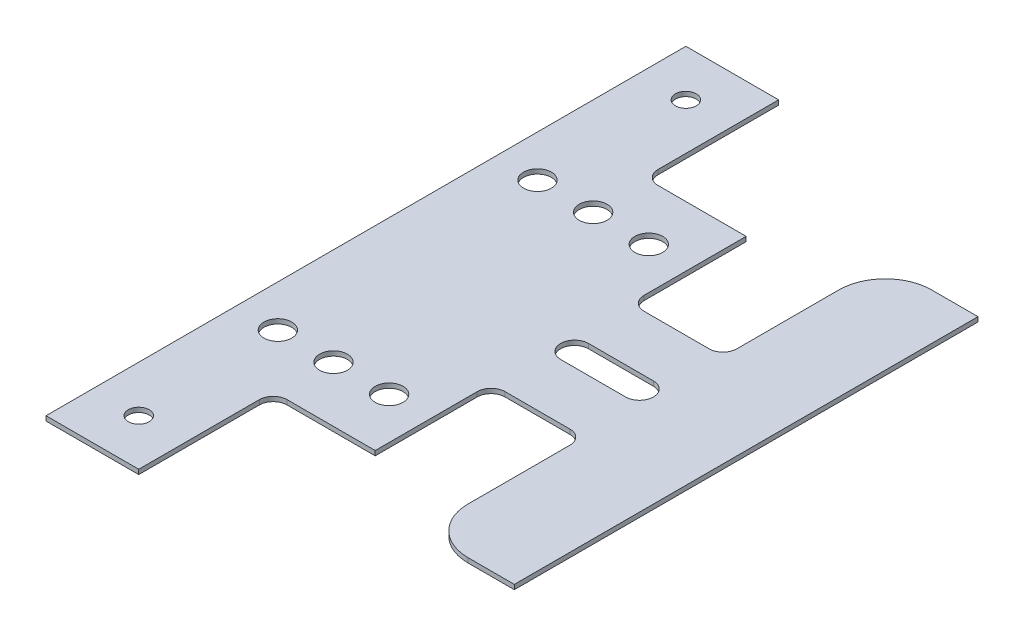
ISO-10303-21;
HEADER;
FILE_DESCRIPTION(('STEP AP214'),'2;1');
FILE_NAME('part.step','',(''),(''),'','','');
FILE_SCHEMA(('AUTOMOTIVE_DESIGN { 1 0 10303 214 1 1 1 1 }'));
ENDSEC;
DATA;
#1=APPLICATION_CONTEXT('core data for automotive mechanical design processes');
#2=APPLICATION_PROTOCOL_DEFINITION('international standard','automotive_design',2000,#1);
#3=PRODUCT_CONTEXT('',#1,'mechanical');
#4=PRODUCT('Part','Part','',(#3));
#5=PRODUCT_RELATED_PRODUCT_CATEGORY('part','',(#4));
#6=PRODUCT_DEFINITION_FORMATION('','',#4);
#7=PRODUCT_DEFINITION_CONTEXT('part definition',#1,'design');
#8=PRODUCT_DEFINITION('design','',#6,#7);
#9=PRODUCT_DEFINITION_SHAPE('','',#8);
#10=(LENGTH_UNIT() NAMED_UNIT(*) SI_UNIT(.MILLI.,.METRE.));
#11=(NAMED_UNIT(*) PLANE_ANGLE_UNIT() SI_UNIT($,.RADIAN.));
#12=(NAMED_UNIT(*) SI_UNIT($,.STERADIAN.) SOLID_ANGLE_UNIT());
#13=UNCERTAINTY_MEASURE_WITH_UNIT(LENGTH_MEASURE(1.E-05),#10,'distance_accuracy_value','');
#14=(GEOMETRIC_REPRESENTATION_CONTEXT(3) GLOBAL_UNCERTAINTY_ASSIGNED_CONTEXT((#13)) GLOBAL_UNIT_ASSIGNED_CONTEXT((#10,
#11,#12)) REPRESENTATION_CONTEXT('',''));
#15=CARTESIAN_POINT('',(0.,0.,0.));
#16=DIRECTION('',(0.,0.,1.));
#17=DIRECTION('',(1.,0.,0.));
#18=AXIS2_PLACEMENT_3D('',#15,#16,#17);
#19=CARTESIAN_POINT('',(72.,1.,-40.));
#20=DIRECTION('',(0.,-1.,0.));
#21=DIRECTION('',(0.,0.,-1.));
#22=AXIS2_PLACEMENT_3D('',#19,#20,#21);
#23=PLANE('',#22);
#24=CARTESIAN_POINT('',(9.,1.,28.));
#25=DIRECTION('',(0.,1.,0.));
#26=DIRECTION('',(0.,0.,-1.));
#27=AXIS2_PLACEMENT_3D('',#24,#25,#26);
#28=CIRCLE('',#27,3.);
#29=CARTESIAN_POINT('',(9.,1.,25.));
#30=VERTEX_POINT('',#29);
#31=EDGE_CURVE('E960',#30,#30,#28,.T.);
#32=ORIENTED_EDGE('',*,*,#31,.F.);
#33=EDGE_LOOP('',(#32));
#34=FACE_BOUND('',#33,.T.);
#35=CARTESIAN_POINT('',(33.,1.,28.));
#36=DIRECTION('',(0.,1.,0.));
#37=DIRECTION('',(0.,0.,-1.));
#38=AXIS2_PLACEMENT_3D('',#35,#36,#37);
#39=CIRCLE('',#38,3.);
#40=CARTESIAN_POINT('',(33.,1.,25.));
#41=VERTEX_POINT('',#40);
#42=EDGE_CURVE('E972',#41,#41,#39,.T.);
#43=ORIENTED_EDGE('',*,*,#42,.F.);
#44=EDGE_LOOP('',(#43));
#45=FACE_BOUND('',#44,.T.);
#46=CARTESIAN_POINT('',(21.,1.,-28.));
#47=DIRECTION('',(0.,1.,0.));
#48=DIRECTION('',(0.,0.,1.));
#49=AXIS2_PLACEMENT_3D('',#46,#47,#48);
#50=CIRCLE('',#49,3.);
#51=CARTESIAN_POINT('',(21.,1.,-25.));
#52=VERTEX_POINT('',#51);
#53=EDGE_CURVE('E984',#52,#52,#50,.T.);
#54=ORIENTED_EDGE('',*,*,#53,.F.);
#55=EDGE_LOOP('',(#54));
#56=FACE_BOUND('',#55,.T.);
#57=CARTESIAN_POINT('',(59.,1.,0.));
#58=DIRECTION('',(0.,1.,0.));
#59=DIRECTION('',(0.,0.,1.));
#60=AXIS2_PLACEMENT_3D('',#57,#58,#59);
#61=CIRCLE('',#60,3.);
#62=CARTESIAN_POINT('',(59.,1.,3.));
#63=VERTEX_POINT('',#62);
#64=CARTESIAN_POINT('',(59.,1.,-3.));
#65=VERTEX_POINT('',#64);
#66=EDGE_CURVE('E218',#63,#65,#61,.T.);
#67=ORIENTED_EDGE('',*,*,#66,.F.);
#68=DIRECTION('',(1.,0.,0.));
#69=VECTOR('',#68,1.);
#70=CARTESIAN_POINT('',(45.,1.,3.));
#71=LINE('',#70,#69);
#72=CARTESIAN_POINT('',(45.,1.,3.));
#73=VERTEX_POINT('',#72);
#74=EDGE_CURVE('E241',#73,#63,#71,.T.);
#75=ORIENTED_EDGE('',*,*,#74,.F.);
#76=CARTESIAN_POINT('',(45.,1.,0.));
#77=DIRECTION('',(0.,1.,0.));
#78=DIRECTION('',(0.,0.,1.));
#79=AXIS2_PLACEMENT_3D('',#76,#77,#78);
#80=CIRCLE('',#79,3.);
#81=CARTESIAN_POINT('',(45.,1.,-3.));
#82=VERTEX_POINT('',#81);
#83=EDGE_CURVE('E239',#82,#73,#80,.T.);
#84=ORIENTED_EDGE('',*,*,#83,.F.);
#85=DIRECTION('',(-1.,0.,0.));
#86=VECTOR('',#85,1.);
#87=CARTESIAN_POINT('',(59.,1.,-3.));
#88=LINE('',#87,#86);
#89=EDGE_CURVE('E226',#65,#82,#88,.T.);
#90=ORIENTED_EDGE('',*,*,#89,.F.);
#91=EDGE_LOOP('',(#67,#75,#84,#90));
#92=FACE_BOUND('',#91,.T.);
#93=CARTESIAN_POINT('',(72.,1.,-40.));
#94=DIRECTION('',(0.,1.,0.));
#95=DIRECTION('',(0.,0.,-1.));
#96=AXIS2_PLACEMENT_3D('',#93,#94,#95);
#97=CIRCLE('',#96,9.99999999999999);
#98=CARTESIAN_POINT('',(72.0000000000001,1.,-50.));
#99=VERTEX_POINT('',#98);
#100=CARTESIAN_POINT('',(62.,1.,-39.9999999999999));
#101=VERTEX_POINT('',#100);
#102=EDGE_CURVE('E263',#99,#101,#97,.T.);
#103=ORIENTED_EDGE('',*,*,#102,.T.);
#104=DIRECTION('',(0.,0.,1.));
#105=VECTOR('',#104,1.);
#106=CARTESIAN_POINT('',(62.,1.,-18.));
#107=LINE('',#106,#105);
#108=CARTESIAN_POINT('',(62.,1.,-18.));
#109=VERTEX_POINT('',#108);
#110=EDGE_CURVE('E266',#101,#109,#107,.T.);
#111=ORIENTED_EDGE('',*,*,#110,.T.);
#112=CARTESIAN_POINT('',(59.,1.,-18.));
#113=DIRECTION('',(0.,-1.,0.));
#114=DIRECTION('',(0.,0.,1.));
#115=AXIS2_PLACEMENT_3D('',#112,#113,#114);
#116=CIRCLE('',#115,3.);
#117=CARTESIAN_POINT('',(59.,1.,-15.));
#118=VERTEX_POINT('',#117);
#119=EDGE_CURVE('E269',#109,#118,#116,.T.);
#120=ORIENTED_EDGE('',*,*,#119,.T.);
#121=DIRECTION('',(-1.,0.,0.));
#122=VECTOR('',#121,1.);
#123=CARTESIAN_POINT('',(45.,1.,-15.));
#124=LINE('',#123,#122);
#125=CARTESIAN_POINT('',(45.,1.,-15.));
#126=VERTEX_POINT('',#125);
#127=EDGE_CURVE('E271',#118,#126,#124,.T.);
#128=ORIENTED_EDGE('',*,*,#127,.T.);
#129=CARTESIAN_POINT('',(45.,1.,-18.));
#130=DIRECTION('',(0.,-1.,0.));
#131=DIRECTION('',(0.,0.,-1.));
#132=AXIS2_PLACEMENT_3D('',#129,#130,#131);
#133=CIRCLE('',#132,3.);
#134=CARTESIAN_POINT('',(42.,1.,-18.));
#135=VERTEX_POINT('',#134);
#136=EDGE_CURVE('E273',#126,#135,#133,.T.);
#137=ORIENTED_EDGE('',*,*,#136,.T.);
#138=DIRECTION('',(0.,0.,-1.));
#139=VECTOR('',#138,1.);
#140=CARTESIAN_POINT('',(42.,1.,-40.));
#141=LINE('',#140,#139);
#142=CARTESIAN_POINT('',(42.,1.,-40.));
#143=VERTEX_POINT('',#142);
#144=EDGE_CURVE('E275',#135,#143,#141,.T.);
#145=ORIENTED_EDGE('',*,*,#144,.T.);
#146=DIRECTION('',(-1.,0.,0.));
#147=VECTOR('',#146,1.);
#148=CARTESIAN_POINT('',(23.,1.,-40.));
#149=LINE('',#148,#147);
#150=CARTESIAN_POINT('',(23.,1.,-40.));
#151=VERTEX_POINT('',#150);
#152=EDGE_CURVE('E277',#143,#151,#149,.T.);
#153=ORIENTED_EDGE('',*,*,#152,.T.);
#154=CARTESIAN_POINT('',(23.,1.,-43.));
#155=DIRECTION('',(0.,-1.,0.));
#156=DIRECTION('',(0.,0.,-1.));
#157=AXIS2_PLACEMENT_3D('',#154,#155,#156);
#158=CIRCLE('',#157,3.);
#159=CARTESIAN_POINT('',(20.,1.,-43.));
#160=VERTEX_POINT('',#159);
#161=EDGE_CURVE('E279',#151,#160,#158,.T.);
#162=ORIENTED_EDGE('',*,*,#161,.T.);
#163=DIRECTION('',(0.,0.,-1.));
#164=VECTOR('',#163,1.);
#165=CARTESIAN_POINT('',(20.,1.,-69.));
#166=LINE('',#165,#164);
#167=CARTESIAN_POINT('',(20.,1.,-69.));
#168=VERTEX_POINT('',#167);
#169=EDGE_CURVE('E281',#160,#168,#166,.T.);
#170=ORIENTED_EDGE('',*,*,#169,.T.);
#171=DIRECTION('',(-1.,0.,0.));
#172=VECTOR('',#171,1.);
#173=CARTESIAN_POINT('',(0.,1.,-69.));
#174=LINE('',#173,#172);
#175=CARTESIAN_POINT('',(0.,1.,-69.));
#176=VERTEX_POINT('',#175);
#177=EDGE_CURVE('E283',#168,#176,#174,.T.);
#178=ORIENTED_EDGE('',*,*,#177,.T.);
#179=DIRECTION('',(0.,0.,1.));
#180=VECTOR('',#179,1.);
#181=CARTESIAN_POINT('',(0.,1.,69.));
#182=LINE('',#181,#180);
#183=CARTESIAN_POINT('',(0.,1.,69.));
#184=VERTEX_POINT('',#183);
#185=EDGE_CURVE('E285',#176,#184,#182,.T.);
#186=ORIENTED_EDGE('',*,*,#185,.T.);
#187=DIRECTION('',(1.,0.,0.));
#188=VECTOR('',#187,1.);
#189=CARTESIAN_POINT('',(0.,1.,69.));
#190=LINE('',#189,#188);
#191=CARTESIAN_POINT('',(20.,1.,69.));
#192=VERTEX_POINT('',#191);
#193=EDGE_CURVE('E287',#184,#192,#190,.T.);
#194=ORIENTED_EDGE('',*,*,#193,.T.);
#195=DIRECTION('',(0.,0.,-1.));
#196=VECTOR('',#195,1.);
#197=CARTESIAN_POINT('',(20.,1.,69.));
#198=LINE('',#197,#196);
#199=CARTESIAN_POINT('',(20.,1.,43.));
#200=VERTEX_POINT('',#199);
#201=EDGE_CURVE('E289',#192,#200,#198,.T.);
#202=ORIENTED_EDGE('',*,*,#201,.T.);
#203=CARTESIAN_POINT('',(23.,1.,43.));
#204=DIRECTION('',(0.,-1.,0.));
#205=DIRECTION('',(0.,0.,1.));
#206=AXIS2_PLACEMENT_3D('',#203,#204,#205);
#207=CIRCLE('',#206,3.);
#208=CARTESIAN_POINT('',(23.,1.,40.));
#209=VERTEX_POINT('',#208);
#210=EDGE_CURVE('E291',#200,#209,#207,.T.);
#211=ORIENTED_EDGE('',*,*,#210,.T.);
#212=DIRECTION('',(1.,0.,0.));
#213=VECTOR('',#212,1.);
#214=CARTESIAN_POINT('',(23.,1.,40.));
#215=LINE('',#214,#213);
#216=CARTESIAN_POINT('',(42.,1.,40.));
#217=VERTEX_POINT('',#216);
#218=EDGE_CURVE('E293',#209,#217,#215,.T.);
#219=ORIENTED_EDGE('',*,*,#218,.T.);
#220=DIRECTION('',(0.,0.,-1.));
#221=VECTOR('',#220,1.);
#222=CARTESIAN_POINT('',(42.,1.,40.));
#223=LINE('',#222,#221);
#224=CARTESIAN_POINT('',(42.,1.,18.));
#225=VERTEX_POINT('',#224);
#226=EDGE_CURVE('E295',#217,#225,#223,.T.);
#227=ORIENTED_EDGE('',*,*,#226,.T.);
#228=CARTESIAN_POINT('',(45.,1.,18.));
#229=DIRECTION('',(0.,-1.,0.));
#230=DIRECTION('',(0.,0.,1.));
#231=AXIS2_PLACEMENT_3D('',#228,#229,#230);
#232=CIRCLE('',#231,3.);
#233=CARTESIAN_POINT('',(45.,1.,15.));
#234=VERTEX_POINT('',#233);
#235=EDGE_CURVE('E297',#225,#234,#232,.T.);
#236=ORIENTED_EDGE('',*,*,#235,.T.);
#237=DIRECTION('',(1.,0.,0.));
#238=VECTOR('',#237,1.);
#239=CARTESIAN_POINT('',(45.,1.,15.));
#240=LINE('',#239,#238);
#241=CARTESIAN_POINT('',(59.,1.,15.));
#242=VERTEX_POINT('',#241);
#243=EDGE_CURVE('E299',#234,#242,#240,.T.);
#244=ORIENTED_EDGE('',*,*,#243,.T.);
#245=CARTESIAN_POINT('',(59.,1.,18.));
#246=DIRECTION('',(0.,-1.,0.));
#247=DIRECTION('',(0.,0.,-1.));
#248=AXIS2_PLACEMENT_3D('',#245,#246,#247);
#249=CIRCLE('',#248,3.);
#250=CARTESIAN_POINT('',(62.,1.,18.));
#251=VERTEX_POINT('',#250);
#252=EDGE_CURVE('E301',#242,#251,#249,.T.);
#253=ORIENTED_EDGE('',*,*,#252,.T.);
#254=DIRECTION('',(0.,0.,1.));
#255=VECTOR('',#254,1.);
#256=CARTESIAN_POINT('',(62.,1.,18.));
#257=LINE('',#256,#255);
#258=CARTESIAN_POINT('',(62.,1.,39.9999999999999));
#259=VERTEX_POINT('',#258);
#260=EDGE_CURVE('E303',#251,#259,#257,.T.);
#261=ORIENTED_EDGE('',*,*,#260,.T.);
#262=CARTESIAN_POINT('',(72.,1.,40.));
#263=DIRECTION('',(0.,1.,0.));
#264=DIRECTION('',(0.,0.,1.));
#265=AXIS2_PLACEMENT_3D('',#262,#263,#264);
#266=CIRCLE('',#265,9.99999999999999);
#267=CARTESIAN_POINT('',(72.0000000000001,1.,50.));
#268=VERTEX_POINT('',#267);
#269=EDGE_CURVE('E305',#259,#268,#266,.T.);
#270=ORIENTED_EDGE('',*,*,#269,.T.);
#271=DIRECTION('',(1.,0.,0.));
#272=VECTOR('',#271,1.);
#273=CARTESIAN_POINT('',(72.0000000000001,1.,50.));
#274=LINE('',#273,#272);
#275=CARTESIAN_POINT('',(82.,1.,50.));
#276=VERTEX_POINT('',#275);
#277=EDGE_CURVE('E307',#268,#276,#274,.T.);
#278=ORIENTED_EDGE('',*,*,#277,.T.);
#279=DIRECTION('',(0.,0.,-1.));
#280=VECTOR('',#279,1.);
#281=CARTESIAN_POINT('',(82.,1.,-50.));
#282=LINE('',#281,#280);
#283=CARTESIAN_POINT('',(82.,1.,-50.));
#284=VERTEX_POINT('',#283);
#285=EDGE_CURVE('E309',#276,#284,#282,.T.);
#286=ORIENTED_EDGE('',*,*,#285,.T.);
#287=DIRECTION('',(-1.,0.,0.));
#288=VECTOR('',#287,1.);
#289=CARTESIAN_POINT('',(72.0000000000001,1.,-50.));
#290=LINE('',#289,#288);
#291=EDGE_CURVE('E311',#284,#99,#290,.T.);
#292=ORIENTED_EDGE('',*,*,#291,.T.);
#293=EDGE_LOOP('',(#103,#111,#120,#128,#137,#145,#153,#162,#170,#178,#186,#194,#202,#211,#219,
#227,#236,#244,#253,#261,#270,#278,#286,#292));
#294=FACE_BOUND('',#293,.T.);
#295=CARTESIAN_POINT('',(10.,1.,-59.));
#296=DIRECTION('',(0.,1.,0.));
#297=DIRECTION('',(0.,0.,1.));
#298=AXIS2_PLACEMENT_3D('',#295,#296,#297);
#299=CIRCLE('',#298,2.25);
#300=CARTESIAN_POINT('',(10.,1.,-56.75));
#301=VERTEX_POINT('',#300);
#302=EDGE_CURVE('E257',#301,#301,#299,.T.);
#303=ORIENTED_EDGE('',*,*,#302,.F.);
#304=EDGE_LOOP('',(#303));
#305=FACE_BOUND('',#304,.T.);
#306=CARTESIAN_POINT('',(9.,1.,-28.));
#307=DIRECTION('',(0.,1.,0.));
#308=DIRECTION('',(0.,0.,1.));
#309=AXIS2_PLACEMENT_3D('',#306,#307,#308);
#310=CIRCLE('',#309,3.);
#311=CARTESIAN_POINT('',(9.,1.,-25.));
#312=VERTEX_POINT('',#311);
#313=EDGE_CURVE('E247',#312,#312,#310,.T.);
#314=ORIENTED_EDGE('',*,*,#313,.F.);
#315=EDGE_LOOP('',(#314));
#316=FACE_BOUND('',#315,.T.);
#317=CARTESIAN_POINT('',(33.,1.,-28.));
#318=DIRECTION('',(0.,1.,0.));
#319=DIRECTION('',(0.,0.,1.));
#320=AXIS2_PLACEMENT_3D('',#317,#318,#319);
#321=CIRCLE('',#320,3.);
#322=CARTESIAN_POINT('',(33.,1.,-25.));
#323=VERTEX_POINT('',#322);
#324=EDGE_CURVE('E978',#323,#323,#321,.T.);
#325=ORIENTED_EDGE('',*,*,#324,.F.);
#326=EDGE_LOOP('',(#325));
#327=FACE_BOUND('',#326,.T.);
#328=CARTESIAN_POINT('',(21.,1.,28.));
#329=DIRECTION('',(0.,1.,0.));
#330=DIRECTION('',(0.,0.,-1.));
#331=AXIS2_PLACEMENT_3D('',#328,#329,#330);
#332=CIRCLE('',#331,3.);
#333=CARTESIAN_POINT('',(21.,1.,25.));
#334=VERTEX_POINT('',#333);
#335=EDGE_CURVE('E966',#334,#334,#332,.T.);
#336=ORIENTED_EDGE('',*,*,#335,.F.);
#337=EDGE_LOOP('',(#336));
#338=FACE_BOUND('',#337,.T.);
#339=CARTESIAN_POINT('',(10.,1.,59.));
#340=DIRECTION('',(0.,1.,0.));
#341=DIRECTION('',(0.,0.,-1.));
#342=AXIS2_PLACEMENT_3D('',#339,#340,#341);
#343=CIRCLE('',#342,2.25);
#344=CARTESIAN_POINT('',(10.,1.,56.75));
#345=VERTEX_POINT('',#344);
#346=EDGE_CURVE('E951',#345,#345,#343,.T.);
#347=ORIENTED_EDGE('',*,*,#346,.F.);
#348=EDGE_LOOP('',(#347));
#349=FACE_BOUND('',#348,.T.);
#350=ADVANCED_FACE('F33',(#34,#45,#56,#92,#294,#305,#316,#327,#338,#349),#23,.F.);
#351=CARTESIAN_POINT('',(72.,0.,-40.));
#352=DIRECTION('',(0.,-1.,0.));
#353=DIRECTION('',(0.,0.,-1.));
#354=AXIS2_PLACEMENT_3D('',#351,#352,#353);
#355=PLANE('',#354);
#356=CARTESIAN_POINT('',(9.,0.,28.));
#357=DIRECTION('',(0.,1.,0.));
#358=DIRECTION('',(0.,0.,-1.));
#359=AXIS2_PLACEMENT_3D('',#356,#357,#358);
#360=CIRCLE('',#359,3.);
#361=CARTESIAN_POINT('',(9.,0.,25.));
#362=VERTEX_POINT('',#361);
#363=EDGE_CURVE('E957',#362,#362,#360,.T.);
#364=ORIENTED_EDGE('',*,*,#363,.T.);
#365=EDGE_LOOP('',(#364));
#366=FACE_BOUND('',#365,.T.);
#367=CARTESIAN_POINT('',(33.,0.,28.));
#368=DIRECTION('',(0.,1.,0.));
#369=DIRECTION('',(0.,0.,-1.));
#370=AXIS2_PLACEMENT_3D('',#367,#368,#369);
#371=CIRCLE('',#370,3.);
#372=CARTESIAN_POINT('',(33.,0.,25.));
#373=VERTEX_POINT('',#372);
#374=EDGE_CURVE('E969',#373,#373,#371,.T.);
#375=ORIENTED_EDGE('',*,*,#374,.T.);
#376=EDGE_LOOP('',(#375));
#377=FACE_BOUND('',#376,.T.);
#378=CARTESIAN_POINT('',(21.,0.,-28.));
#379=DIRECTION('',(0.,1.,0.));
#380=DIRECTION('',(0.,0.,1.));
#381=AXIS2_PLACEMENT_3D('',#378,#379,#380);
#382=CIRCLE('',#381,3.);
#383=CARTESIAN_POINT('',(21.,0.,-25.));
#384=VERTEX_POINT('',#383);
#385=EDGE_CURVE('E981',#384,#384,#382,.T.);
#386=ORIENTED_EDGE('',*,*,#385,.T.);
#387=EDGE_LOOP('',(#386));
#388=FACE_BOUND('',#387,.T.);
#389=DIRECTION('',(1.,0.,0.));
#390=VECTOR('',#389,1.);
#391=CARTESIAN_POINT('',(45.,0.,3.));
#392=LINE('',#391,#390);
#393=CARTESIAN_POINT('',(45.,0.,3.));
#394=VERTEX_POINT('',#393);
#395=CARTESIAN_POINT('',(59.,0.,3.));
#396=VERTEX_POINT('',#395);
#397=EDGE_CURVE('E227',#394,#396,#392,.T.);
#398=ORIENTED_EDGE('',*,*,#397,.T.);
#399=CARTESIAN_POINT('',(59.,0.,0.));
#400=DIRECTION('',(0.,1.,0.));
#401=DIRECTION('',(0.,0.,1.));
#402=AXIS2_PLACEMENT_3D('',#399,#400,#401);
#403=CIRCLE('',#402,3.);
#404=CARTESIAN_POINT('',(59.,0.,-3.));
#405=VERTEX_POINT('',#404);
#406=EDGE_CURVE('E56',#396,#405,#403,.T.);
#407=ORIENTED_EDGE('',*,*,#406,.T.);
#408=DIRECTION('',(-1.,0.,0.));
#409=VECTOR('',#408,1.);
#410=CARTESIAN_POINT('',(59.,0.,-3.));
#411=LINE('',#410,#409);
#412=CARTESIAN_POINT('',(45.,0.,-3.));
#413=VERTEX_POINT('',#412);
#414=EDGE_CURVE('E233',#405,#413,#411,.T.);
#415=ORIENTED_EDGE('',*,*,#414,.T.);
#416=CARTESIAN_POINT('',(45.,0.,0.));
#417=DIRECTION('',(0.,1.,0.));
#418=DIRECTION('',(0.,0.,1.));
#419=AXIS2_PLACEMENT_3D('',#416,#417,#418);
#420=CIRCLE('',#419,3.);
#421=EDGE_CURVE('E249',#413,#394,#420,.T.);
#422=ORIENTED_EDGE('',*,*,#421,.T.);
#423=EDGE_LOOP('',(#398,#407,#415,#422));
#424=FACE_BOUND('',#423,.T.);
#425=CARTESIAN_POINT('',(72.,0.,-40.));
#426=DIRECTION('',(0.,1.,0.));
#427=DIRECTION('',(0.,0.,-1.));
#428=AXIS2_PLACEMENT_3D('',#425,#426,#427);
#429=CIRCLE('',#428,9.99999999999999);
#430=CARTESIAN_POINT('',(72.0000000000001,0.,-50.));
#431=VERTEX_POINT('',#430);
#432=CARTESIAN_POINT('',(62.,0.,-39.9999999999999));
#433=VERTEX_POINT('',#432);
#434=EDGE_CURVE('E260',#431,#433,#429,.T.);
#435=ORIENTED_EDGE('',*,*,#434,.F.);
#436=DIRECTION('',(-1.,0.,0.));
#437=VECTOR('',#436,1.);
#438=CARTESIAN_POINT('',(72.0000000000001,0.,-50.));
#439=LINE('',#438,#437);
#440=CARTESIAN_POINT('',(82.,0.,-50.));
#441=VERTEX_POINT('',#440);
#442=EDGE_CURVE('E267',#441,#431,#439,.T.);
#443=ORIENTED_EDGE('',*,*,#442,.F.);
#444=DIRECTION('',(0.,0.,-1.));
#445=VECTOR('',#444,1.);
#446=CARTESIAN_POINT('',(82.,0.,-50.));
#447=LINE('',#446,#445);
#448=CARTESIAN_POINT('',(82.,0.,50.));
#449=VERTEX_POINT('',#448);
#450=EDGE_CURVE('E358',#449,#441,#447,.T.);
#451=ORIENTED_EDGE('',*,*,#450,.F.);
#452=DIRECTION('',(1.,0.,0.));
#453=VECTOR('',#452,1.);
#454=CARTESIAN_POINT('',(72.0000000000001,0.,50.));
#455=LINE('',#454,#453);
#456=CARTESIAN_POINT('',(72.0000000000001,0.,50.));
#457=VERTEX_POINT('',#456);
#458=EDGE_CURVE('E356',#457,#449,#455,.T.);
#459=ORIENTED_EDGE('',*,*,#458,.F.);
#460=CARTESIAN_POINT('',(72.,0.,40.));
#461=DIRECTION('',(0.,1.,0.));
#462=DIRECTION('',(0.,0.,1.));
#463=AXIS2_PLACEMENT_3D('',#460,#461,#462);
#464=CIRCLE('',#463,9.99999999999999);
#465=CARTESIAN_POINT('',(62.,0.,39.9999999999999));
#466=VERTEX_POINT('',#465);
#467=EDGE_CURVE('E354',#466,#457,#464,.T.);
#468=ORIENTED_EDGE('',*,*,#467,.F.);
#469=DIRECTION('',(0.,0.,1.));
#470=VECTOR('',#469,1.);
#471=CARTESIAN_POINT('',(62.,0.,18.));
#472=LINE('',#471,#470);
#473=CARTESIAN_POINT('',(62.,0.,18.));
#474=VERTEX_POINT('',#473);
#475=EDGE_CURVE('E352',#474,#466,#472,.T.);
#476=ORIENTED_EDGE('',*,*,#475,.F.);
#477=CARTESIAN_POINT('',(59.,0.,18.));
#478=DIRECTION('',(0.,-1.,0.));
#479=DIRECTION('',(0.,0.,-1.));
#480=AXIS2_PLACEMENT_3D('',#477,#478,#479);
#481=CIRCLE('',#480,3.);
#482=CARTESIAN_POINT('',(59.,0.,15.));
#483=VERTEX_POINT('',#482);
#484=EDGE_CURVE('E350',#483,#474,#481,.T.);
#485=ORIENTED_EDGE('',*,*,#484,.F.);
#486=DIRECTION('',(1.,0.,0.));
#487=VECTOR('',#486,1.);
#488=CARTESIAN_POINT('',(45.,0.,15.));
#489=LINE('',#488,#487);
#490=CARTESIAN_POINT('',(45.,0.,15.));
#491=VERTEX_POINT('',#490);
#492=EDGE_CURVE('E348',#491,#483,#489,.T.);
#493=ORIENTED_EDGE('',*,*,#492,.F.);
#494=CARTESIAN_POINT('',(45.,0.,18.));
#495=DIRECTION('',(0.,-1.,0.));
#496=DIRECTION('',(0.,0.,1.));
#497=AXIS2_PLACEMENT_3D('',#494,#495,#496);
#498=CIRCLE('',#497,3.);
#499=CARTESIAN_POINT('',(42.,0.,18.));
#500=VERTEX_POINT('',#499);
#501=EDGE_CURVE('E346',#500,#491,#498,.T.);
#502=ORIENTED_EDGE('',*,*,#501,.F.);
#503=DIRECTION('',(0.,0.,-1.));
#504=VECTOR('',#503,1.);
#505=CARTESIAN_POINT('',(42.,0.,40.));
#506=LINE('',#505,#504);
#507=CARTESIAN_POINT('',(42.,0.,40.));
#508=VERTEX_POINT('',#507);
#509=EDGE_CURVE('E344',#508,#500,#506,.T.);
#510=ORIENTED_EDGE('',*,*,#509,.F.);
#511=DIRECTION('',(1.,0.,0.));
#512=VECTOR('',#511,1.);
#513=CARTESIAN_POINT('',(23.,0.,40.));
#514=LINE('',#513,#512);
#515=CARTESIAN_POINT('',(23.,0.,40.));
#516=VERTEX_POINT('',#515);
#517=EDGE_CURVE('E342',#516,#508,#514,.T.);
#518=ORIENTED_EDGE('',*,*,#517,.F.);
#519=CARTESIAN_POINT('',(23.,0.,43.));
#520=DIRECTION('',(0.,-1.,0.));
#521=DIRECTION('',(0.,0.,1.));
#522=AXIS2_PLACEMENT_3D('',#519,#520,#521);
#523=CIRCLE('',#522,3.);
#524=CARTESIAN_POINT('',(20.,0.,43.));
#525=VERTEX_POINT('',#524);
#526=EDGE_CURVE('E340',#525,#516,#523,.T.);
#527=ORIENTED_EDGE('',*,*,#526,.F.);
#528=DIRECTION('',(0.,0.,-1.));
#529=VECTOR('',#528,1.);
#530=CARTESIAN_POINT('',(20.,0.,69.));
#531=LINE('',#530,#529);
#532=CARTESIAN_POINT('',(20.,0.,69.));
#533=VERTEX_POINT('',#532);
#534=EDGE_CURVE('E338',#533,#525,#531,.T.);
#535=ORIENTED_EDGE('',*,*,#534,.F.);
#536=DIRECTION('',(1.,0.,0.));
#537=VECTOR('',#536,1.);
#538=CARTESIAN_POINT('',(0.,0.,69.));
#539=LINE('',#538,#537);
#540=CARTESIAN_POINT('',(0.,0.,69.));
#541=VERTEX_POINT('',#540);
#542=EDGE_CURVE('E336',#541,#533,#539,.T.);
#543=ORIENTED_EDGE('',*,*,#542,.F.);
#544=DIRECTION('',(0.,0.,1.));
#545=VECTOR('',#544,1.);
#546=CARTESIAN_POINT('',(0.,0.,69.));
#547=LINE('',#546,#545);
#548=CARTESIAN_POINT('',(0.,0.,-69.));
#549=VERTEX_POINT('',#548);
#550=EDGE_CURVE('E334',#549,#541,#547,.T.);
#551=ORIENTED_EDGE('',*,*,#550,.F.);
#552=DIRECTION('',(-1.,0.,0.));
#553=VECTOR('',#552,1.);
#554=CARTESIAN_POINT('',(0.,0.,-69.));
#555=LINE('',#554,#553);
#556=CARTESIAN_POINT('',(20.,0.,-69.));
#557=VERTEX_POINT('',#556);
#558=EDGE_CURVE('E332',#557,#549,#555,.T.);
#559=ORIENTED_EDGE('',*,*,#558,.F.);
#560=DIRECTION('',(0.,0.,-1.));
#561=VECTOR('',#560,1.);
#562=CARTESIAN_POINT('',(20.,0.,-69.));
#563=LINE('',#562,#561);
#564=CARTESIAN_POINT('',(20.,0.,-43.));
#565=VERTEX_POINT('',#564);
#566=EDGE_CURVE('E330',#565,#557,#563,.T.);
#567=ORIENTED_EDGE('',*,*,#566,.F.);
#568=CARTESIAN_POINT('',(23.,0.,-43.));
#569=DIRECTION('',(0.,-1.,0.));
#570=DIRECTION('',(0.,0.,-1.));
#571=AXIS2_PLACEMENT_3D('',#568,#569,#570);
#572=CIRCLE('',#571,3.);
#573=CARTESIAN_POINT('',(23.,0.,-40.));
#574=VERTEX_POINT('',#573);
#575=EDGE_CURVE('E328',#574,#565,#572,.T.);
#576=ORIENTED_EDGE('',*,*,#575,.F.);
#577=DIRECTION('',(-1.,0.,0.));
#578=VECTOR('',#577,1.);
#579=CARTESIAN_POINT('',(23.,0.,-40.));
#580=LINE('',#579,#578);
#581=CARTESIAN_POINT('',(42.,0.,-40.));
#582=VERTEX_POINT('',#581);
#583=EDGE_CURVE('E326',#582,#574,#580,.T.);
#584=ORIENTED_EDGE('',*,*,#583,.F.);
#585=DIRECTION('',(0.,0.,-1.));
#586=VECTOR('',#585,1.);
#587=CARTESIAN_POINT('',(42.,0.,-40.));
#588=LINE('',#587,#586);
#589=CARTESIAN_POINT('',(42.,0.,-18.));
#590=VERTEX_POINT('',#589);
#591=EDGE_CURVE('E324',#590,#582,#588,.T.);
#592=ORIENTED_EDGE('',*,*,#591,.F.);
#593=CARTESIAN_POINT('',(45.,0.,-18.));
#594=DIRECTION('',(0.,-1.,0.));
#595=DIRECTION('',(0.,0.,-1.));
#596=AXIS2_PLACEMENT_3D('',#593,#594,#595);
#597=CIRCLE('',#596,3.);
#598=CARTESIAN_POINT('',(45.,0.,-15.));
#599=VERTEX_POINT('',#598);
#600=EDGE_CURVE('E322',#599,#590,#597,.T.);
#601=ORIENTED_EDGE('',*,*,#600,.F.);
#602=DIRECTION('',(-1.,0.,0.));
#603=VECTOR('',#602,1.);
#604=CARTESIAN_POINT('',(45.,0.,-15.));
#605=LINE('',#604,#603);
#606=CARTESIAN_POINT('',(59.,0.,-15.));
#607=VERTEX_POINT('',#606);
#608=EDGE_CURVE('E320',#607,#599,#605,.T.);
#609=ORIENTED_EDGE('',*,*,#608,.F.);
#610=CARTESIAN_POINT('',(59.,0.,-18.));
#611=DIRECTION('',(0.,-1.,0.));
#612=DIRECTION('',(0.,0.,1.));
#613=AXIS2_PLACEMENT_3D('',#610,#611,#612);
#614=CIRCLE('',#613,3.);
#615=CARTESIAN_POINT('',(62.,0.,-18.));
#616=VERTEX_POINT('',#615);
#617=EDGE_CURVE('E318',#616,#607,#614,.T.);
#618=ORIENTED_EDGE('',*,*,#617,.F.);
#619=DIRECTION('',(0.,0.,1.));
#620=VECTOR('',#619,1.);
#621=CARTESIAN_POINT('',(62.,0.,-18.));
#622=LINE('',#621,#620);
#623=EDGE_CURVE('E316',#433,#616,#622,.T.);
#624=ORIENTED_EDGE('',*,*,#623,.F.);
#625=EDGE_LOOP('',(#435,#443,#451,#459,#468,#476,#485,#493,#502,#510,#518,#527,#535,#543,#551,
#559,#567,#576,#584,#592,#601,#609,#618,#624));
#626=FACE_BOUND('',#625,.T.);
#627=CARTESIAN_POINT('',(10.,0.,-59.));
#628=DIRECTION('',(0.,1.,0.));
#629=DIRECTION('',(0.,0.,1.));
#630=AXIS2_PLACEMENT_3D('',#627,#628,#629);
#631=CIRCLE('',#630,2.25);
#632=CARTESIAN_POINT('',(10.,0.,-56.75));
#633=VERTEX_POINT('',#632);
#634=EDGE_CURVE('E234',#633,#633,#631,.T.);
#635=ORIENTED_EDGE('',*,*,#634,.T.);
#636=EDGE_LOOP('',(#635));
#637=FACE_BOUND('',#636,.T.);
#638=CARTESIAN_POINT('',(9.,0.,-28.));
#639=DIRECTION('',(0.,1.,0.));
#640=DIRECTION('',(0.,0.,1.));
#641=AXIS2_PLACEMENT_3D('',#638,#639,#640);
#642=CIRCLE('',#641,3.);
#643=CARTESIAN_POINT('',(9.,0.,-25.));
#644=VERTEX_POINT('',#643);
#645=EDGE_CURVE('E987',#644,#644,#642,.T.);
#646=ORIENTED_EDGE('',*,*,#645,.T.);
#647=EDGE_LOOP('',(#646));
#648=FACE_BOUND('',#647,.T.);
#649=CARTESIAN_POINT('',(33.,0.,-28.));
#650=DIRECTION('',(0.,1.,0.));
#651=DIRECTION('',(0.,0.,1.));
#652=AXIS2_PLACEMENT_3D('',#649,#650,#651);
#653=CIRCLE('',#652,3.);
#654=CARTESIAN_POINT('',(33.,0.,-25.));
#655=VERTEX_POINT('',#654);
#656=EDGE_CURVE('E975',#655,#655,#653,.T.);
#657=ORIENTED_EDGE('',*,*,#656,.T.);
#658=EDGE_LOOP('',(#657));
#659=FACE_BOUND('',#658,.T.);
#660=CARTESIAN_POINT('',(21.,0.,28.));
#661=DIRECTION('',(0.,1.,0.));
#662=DIRECTION('',(0.,0.,-1.));
#663=AXIS2_PLACEMENT_3D('',#660,#661,#662);
#664=CIRCLE('',#663,3.);
#665=CARTESIAN_POINT('',(21.,0.,25.));
#666=VERTEX_POINT('',#665);
#667=EDGE_CURVE('E963',#666,#666,#664,.T.);
#668=ORIENTED_EDGE('',*,*,#667,.T.);
#669=EDGE_LOOP('',(#668));
#670=FACE_BOUND('',#669,.T.);
#671=CARTESIAN_POINT('',(10.,0.,59.));
#672=DIRECTION('',(0.,1.,0.));
#673=DIRECTION('',(0.,0.,-1.));
#674=AXIS2_PLACEMENT_3D('',#671,#672,#673);
#675=CIRCLE('',#674,2.25);
#676=CARTESIAN_POINT('',(10.,0.,56.75));
#677=VERTEX_POINT('',#676);
#678=EDGE_CURVE('E954',#677,#677,#675,.T.);
#679=ORIENTED_EDGE('',*,*,#678,.T.);
#680=EDGE_LOOP('',(#679));
#681=FACE_BOUND('',#680,.T.);
#682=ADVANCED_FACE('F436',(#366,#377,#388,#424,#626,#637,#648,#659,#670,#681),#355,.T.);
#683=CARTESIAN_POINT('',(72.,1.,-40.));
#684=DIRECTION('',(0.,-1.,0.));
#685=DIRECTION('',(0.,0.,-1.));
#686=AXIS2_PLACEMENT_3D('',#683,#684,#685);
#687=CYLINDRICAL_SURFACE('',#686,9.99999999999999);
#688=ORIENTED_EDGE('',*,*,#434,.T.);
#689=DIRECTION('',(0.,-1.,0.));
#690=VECTOR('',#689,1.);
#691=CARTESIAN_POINT('',(62.,1.,-39.9999999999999));
#692=LINE('',#691,#690);
#693=EDGE_CURVE('E11',#101,#433,#692,.T.);
#694=ORIENTED_EDGE('',*,*,#693,.F.);
#695=ORIENTED_EDGE('',*,*,#102,.F.);
#696=DIRECTION('',(0.,-1.,0.));
#697=VECTOR('',#696,1.);
#698=CARTESIAN_POINT('',(72.0000000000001,1.,-50.));
#699=LINE('',#698,#697);
#700=EDGE_CURVE('E313',#99,#431,#699,.T.);
#701=ORIENTED_EDGE('',*,*,#700,.T.);
#702=EDGE_LOOP('',(#688,#694,#695,#701));
#703=FACE_BOUND('',#702,.T.);
#704=ADVANCED_FACE('F35',(#703),#687,.T.);
#705=CARTESIAN_POINT('',(62.,1.,-18.));
#706=DIRECTION('',(1.,0.,0.));
#707=DIRECTION('',(0.,0.,-1.));
#708=AXIS2_PLACEMENT_3D('',#705,#706,#707);
#709=PLANE('',#708);
#710=ORIENTED_EDGE('',*,*,#623,.T.);
#711=DIRECTION('',(0.,-1.,0.));
#712=VECTOR('',#711,1.);
#713=CARTESIAN_POINT('',(62.,1.,-18.));
#714=LINE('',#713,#712);
#715=EDGE_CURVE('E41',#109,#616,#714,.T.);
#716=ORIENTED_EDGE('',*,*,#715,.F.);
#717=ORIENTED_EDGE('',*,*,#110,.F.);
#718=ORIENTED_EDGE('',*,*,#693,.T.);
#719=EDGE_LOOP('',(#710,#716,#717,#718));
#720=FACE_BOUND('',#719,.T.);
#721=ADVANCED_FACE('F453',(#720),#709,.F.);
#722=CARTESIAN_POINT('',(59.,1.,-18.));
#723=DIRECTION('',(0.,-1.,0.));
#724=DIRECTION('',(0.,0.,-1.));
#725=AXIS2_PLACEMENT_3D('',#722,#723,#724);
#726=CYLINDRICAL_SURFACE('',#725,3.);
#727=ORIENTED_EDGE('',*,*,#617,.T.);
#728=DIRECTION('',(0.,-1.,0.));
#729=VECTOR('',#728,1.);
#730=CARTESIAN_POINT('',(59.,1.,-15.));
#731=LINE('',#730,#729);
#732=EDGE_CURVE('E423',#118,#607,#731,.T.);
#733=ORIENTED_EDGE('',*,*,#732,.F.);
#734=ORIENTED_EDGE('',*,*,#119,.F.);
#735=ORIENTED_EDGE('',*,*,#715,.T.);
#736=EDGE_LOOP('',(#727,#733,#734,#735));
#737=FACE_BOUND('',#736,.T.);
#738=ADVANCED_FACE('F430',(#737),#726,.F.);
#739=CARTESIAN_POINT('',(45.,1.,-15.));
#740=DIRECTION('',(0.,0.,1.));
#741=DIRECTION('',(1.,0.,0.));
#742=AXIS2_PLACEMENT_3D('',#739,#740,#741);
#743=PLANE('',#742);
#744=ORIENTED_EDGE('',*,*,#608,.T.);
#745=DIRECTION('',(0.,-1.,0.));
#746=VECTOR('',#745,1.);
#747=CARTESIAN_POINT('',(45.,1.,-15.));
#748=LINE('',#747,#746);
#749=EDGE_CURVE('E420',#126,#599,#748,.T.);
#750=ORIENTED_EDGE('',*,*,#749,.F.);
#751=ORIENTED_EDGE('',*,*,#127,.F.);
#752=ORIENTED_EDGE('',*,*,#732,.T.);
#753=EDGE_LOOP('',(#744,#750,#751,#752));
#754=FACE_BOUND('',#753,.T.);
#755=ADVANCED_FACE('F442',(#754),#743,.F.);
#756=CARTESIAN_POINT('',(45.,1.,-18.));
#757=DIRECTION('',(0.,-1.,0.));
#758=DIRECTION('',(0.,0.,-1.));
#759=AXIS2_PLACEMENT_3D('',#756,#757,#758);
#760=CYLINDRICAL_SURFACE('',#759,3.);
#761=ORIENTED_EDGE('',*,*,#600,.T.);
#762=DIRECTION('',(0.,-1.,0.));
#763=VECTOR('',#762,1.);
#764=CARTESIAN_POINT('',(42.,1.,-18.));
#765=LINE('',#764,#763);
#766=EDGE_CURVE('E417',#135,#590,#765,.T.);
#767=ORIENTED_EDGE('',*,*,#766,.F.);
#768=ORIENTED_EDGE('',*,*,#136,.F.);
#769=ORIENTED_EDGE('',*,*,#749,.T.);
#770=EDGE_LOOP('',(#761,#767,#768,#769));
#771=FACE_BOUND('',#770,.T.);
#772=ADVANCED_FACE('F446',(#771),#760,.F.);
#773=CARTESIAN_POINT('',(42.,1.,-40.));
#774=DIRECTION('',(-1.,0.,0.));
#775=DIRECTION('',(0.,0.,1.));
#776=AXIS2_PLACEMENT_3D('',#773,#774,#775);
#777=PLANE('',#776);
#778=ORIENTED_EDGE('',*,*,#591,.T.);
#779=DIRECTION('',(0.,-1.,0.));
#780=VECTOR('',#779,1.);
#781=CARTESIAN_POINT('',(42.,1.,-40.));
#782=LINE('',#781,#780);
#783=EDGE_CURVE('E414',#143,#582,#782,.T.);
#784=ORIENTED_EDGE('',*,*,#783,.F.);
#785=ORIENTED_EDGE('',*,*,#144,.F.);
#786=ORIENTED_EDGE('',*,*,#766,.T.);
#787=EDGE_LOOP('',(#778,#784,#785,#786));
#788=FACE_BOUND('',#787,.T.);
#789=ADVANCED_FACE('F546',(#788),#777,.F.);
#790=CARTESIAN_POINT('',(23.,1.,-40.));
#791=DIRECTION('',(0.,0.,1.));
#792=DIRECTION('',(1.,0.,0.));
#793=AXIS2_PLACEMENT_3D('',#790,#791,#792);
#794=PLANE('',#793);
#795=ORIENTED_EDGE('',*,*,#583,.T.);
#796=DIRECTION('',(0.,-1.,0.));
#797=VECTOR('',#796,1.);
#798=CARTESIAN_POINT('',(23.,1.,-40.));
#799=LINE('',#798,#797);
#800=EDGE_CURVE('E411',#151,#574,#799,.T.);
#801=ORIENTED_EDGE('',*,*,#800,.F.);
#802=ORIENTED_EDGE('',*,*,#152,.F.);
#803=ORIENTED_EDGE('',*,*,#783,.T.);
#804=EDGE_LOOP('',(#795,#801,#802,#803));
#805=FACE_BOUND('',#804,.T.);
#806=ADVANCED_FACE('F544',(#805),#794,.F.);
#807=CARTESIAN_POINT('',(23.,1.,-43.));
#808=DIRECTION('',(0.,-1.,0.));
#809=DIRECTION('',(0.,0.,-1.));
#810=AXIS2_PLACEMENT_3D('',#807,#808,#809);
#811=CYLINDRICAL_SURFACE('',#810,3.);
#812=ORIENTED_EDGE('',*,*,#575,.T.);
#813=DIRECTION('',(0.,-1.,0.));
#814=VECTOR('',#813,1.);
#815=CARTESIAN_POINT('',(20.,1.,-43.));
#816=LINE('',#815,#814);
#817=EDGE_CURVE('E408',#160,#565,#816,.T.);
#818=ORIENTED_EDGE('',*,*,#817,.F.);
#819=ORIENTED_EDGE('',*,*,#161,.F.);
#820=ORIENTED_EDGE('',*,*,#800,.T.);
#821=EDGE_LOOP('',(#812,#818,#819,#820));
#822=FACE_BOUND('',#821,.T.);
#823=ADVANCED_FACE('F540',(#822),#811,.F.);
#824=CARTESIAN_POINT('',(20.,1.,-69.));
#825=DIRECTION('',(-1.,0.,0.));
#826=DIRECTION('',(0.,0.,1.));
#827=AXIS2_PLACEMENT_3D('',#824,#825,#826);
#828=PLANE('',#827);
#829=ORIENTED_EDGE('',*,*,#566,.T.);
#830=DIRECTION('',(0.,-1.,0.));
#831=VECTOR('',#830,1.);
#832=CARTESIAN_POINT('',(20.,1.,-69.));
#833=LINE('',#832,#831);
#834=EDGE_CURVE('E405',#168,#557,#833,.T.);
#835=ORIENTED_EDGE('',*,*,#834,.F.);
#836=ORIENTED_EDGE('',*,*,#169,.F.);
#837=ORIENTED_EDGE('',*,*,#817,.T.);
#838=EDGE_LOOP('',(#829,#835,#836,#837));
#839=FACE_BOUND('',#838,.T.);
#840=ADVANCED_FACE('F535',(#839),#828,.F.);
#841=CARTESIAN_POINT('',(0.,1.,-69.));
#842=DIRECTION('',(0.,0.,1.));
#843=DIRECTION('',(1.,0.,0.));
#844=AXIS2_PLACEMENT_3D('',#841,#842,#843);
#845=PLANE('',#844);
#846=ORIENTED_EDGE('',*,*,#558,.T.);
#847=DIRECTION('',(0.,-1.,0.));
#848=VECTOR('',#847,1.);
#849=CARTESIAN_POINT('',(0.,1.,-69.));
#850=LINE('',#849,#848);
#851=EDGE_CURVE('E402',#176,#549,#850,.T.);
#852=ORIENTED_EDGE('',*,*,#851,.F.);
#853=ORIENTED_EDGE('',*,*,#177,.F.);
#854=ORIENTED_EDGE('',*,*,#834,.T.);
#855=EDGE_LOOP('',(#846,#852,#853,#854));
#856=FACE_BOUND('',#855,.T.);
#857=ADVANCED_FACE('F529',(#856),#845,.F.);
#858=CARTESIAN_POINT('',(0.,1.,69.));
#859=DIRECTION('',(1.,0.,0.));
#860=DIRECTION('',(0.,0.,-1.));
#861=AXIS2_PLACEMENT_3D('',#858,#859,#860);
#862=PLANE('',#861);
#863=ORIENTED_EDGE('',*,*,#550,.T.);
#864=DIRECTION('',(0.,-1.,0.));
#865=VECTOR('',#864,1.);
#866=CARTESIAN_POINT('',(0.,1.,69.));
#867=LINE('',#866,#865);
#868=EDGE_CURVE('E399',#184,#541,#867,.T.);
#869=ORIENTED_EDGE('',*,*,#868,.F.);
#870=ORIENTED_EDGE('',*,*,#185,.F.);
#871=ORIENTED_EDGE('',*,*,#851,.T.);
#872=EDGE_LOOP('',(#863,#869,#870,#871));
#873=FACE_BOUND('',#872,.T.);
#874=ADVANCED_FACE('F525',(#873),#862,.F.);
#875=CARTESIAN_POINT('',(0.,1.,69.));
#876=DIRECTION('',(0.,0.,-1.));
#877=DIRECTION('',(-1.,0.,0.));
#878=AXIS2_PLACEMENT_3D('',#875,#876,#877);
#879=PLANE('',#878);
#880=ORIENTED_EDGE('',*,*,#542,.T.);
#881=DIRECTION('',(0.,-1.,0.));
#882=VECTOR('',#881,1.);
#883=CARTESIAN_POINT('',(20.,1.,69.));
#884=LINE('',#883,#882);
#885=EDGE_CURVE('E396',#192,#533,#884,.T.);
#886=ORIENTED_EDGE('',*,*,#885,.F.);
#887=ORIENTED_EDGE('',*,*,#193,.F.);
#888=ORIENTED_EDGE('',*,*,#868,.T.);
#889=EDGE_LOOP('',(#880,#886,#887,#888));
#890=FACE_BOUND('',#889,.T.);
#891=ADVANCED_FACE('F520',(#890),#879,.F.);
#892=CARTESIAN_POINT('',(20.,1.,69.));
#893=DIRECTION('',(-1.,0.,0.));
#894=DIRECTION('',(0.,0.,1.));
#895=AXIS2_PLACEMENT_3D('',#892,#893,#894);
#896=PLANE('',#895);
#897=ORIENTED_EDGE('',*,*,#534,.T.);
#898=DIRECTION('',(0.,-1.,0.));
#899=VECTOR('',#898,1.);
#900=CARTESIAN_POINT('',(20.,1.,43.));
#901=LINE('',#900,#899);
#902=EDGE_CURVE('E393',#200,#525,#901,.T.);
#903=ORIENTED_EDGE('',*,*,#902,.F.);
#904=ORIENTED_EDGE('',*,*,#201,.F.);
#905=ORIENTED_EDGE('',*,*,#885,.T.);
#906=EDGE_LOOP('',(#897,#903,#904,#905));
#907=FACE_BOUND('',#906,.T.);
#908=ADVANCED_FACE('F514',(#907),#896,.F.);
#909=CARTESIAN_POINT('',(23.,1.,43.));
#910=DIRECTION('',(0.,-1.,0.));
#911=DIRECTION('',(0.,0.,-1.));
#912=AXIS2_PLACEMENT_3D('',#909,#910,#911);
#913=CYLINDRICAL_SURFACE('',#912,3.);
#914=ORIENTED_EDGE('',*,*,#526,.T.);
#915=DIRECTION('',(0.,-1.,0.));
#916=VECTOR('',#915,1.);
#917=CARTESIAN_POINT('',(23.,1.,40.));
#918=LINE('',#917,#916);
#919=EDGE_CURVE('E390',#209,#516,#918,.T.);
#920=ORIENTED_EDGE('',*,*,#919,.F.);
#921=ORIENTED_EDGE('',*,*,#210,.F.);
#922=ORIENTED_EDGE('',*,*,#902,.T.);
#923=EDGE_LOOP('',(#914,#920,#921,#922));
#924=FACE_BOUND('',#923,.T.);
#925=ADVANCED_FACE('F510',(#924),#913,.F.);
#926=CARTESIAN_POINT('',(23.,1.,40.));
#927=DIRECTION('',(0.,0.,-1.));
#928=DIRECTION('',(-1.,0.,0.));
#929=AXIS2_PLACEMENT_3D('',#926,#927,#928);
#930=PLANE('',#929);
#931=ORIENTED_EDGE('',*,*,#517,.T.);
#932=DIRECTION('',(0.,-1.,0.));
#933=VECTOR('',#932,1.);
#934=CARTESIAN_POINT('',(42.,1.,40.));
#935=LINE('',#934,#933);
#936=EDGE_CURVE('E387',#217,#508,#935,.T.);
#937=ORIENTED_EDGE('',*,*,#936,.F.);
#938=ORIENTED_EDGE('',*,*,#218,.F.);
#939=ORIENTED_EDGE('',*,*,#919,.T.);
#940=EDGE_LOOP('',(#931,#937,#938,#939));
#941=FACE_BOUND('',#940,.T.);
#942=ADVANCED_FACE('F505',(#941),#930,.F.);
#943=CARTESIAN_POINT('',(42.,1.,40.));
#944=DIRECTION('',(-1.,0.,0.));
#945=DIRECTION('',(0.,0.,1.));
#946=AXIS2_PLACEMENT_3D('',#943,#944,#945);
#947=PLANE('',#946);
#948=ORIENTED_EDGE('',*,*,#509,.T.);
#949=DIRECTION('',(0.,-1.,0.));
#950=VECTOR('',#949,1.);
#951=CARTESIAN_POINT('',(42.,1.,18.));
#952=LINE('',#951,#950);
#953=EDGE_CURVE('E384',#225,#500,#952,.T.);
#954=ORIENTED_EDGE('',*,*,#953,.F.);
#955=ORIENTED_EDGE('',*,*,#226,.F.);
#956=ORIENTED_EDGE('',*,*,#936,.T.);
#957=EDGE_LOOP('',(#948,#954,#955,#956));
#958=FACE_BOUND('',#957,.T.);
#959=ADVANCED_FACE('F499',(#958),#947,.F.);
#960=CARTESIAN_POINT('',(45.,1.,18.));
#961=DIRECTION('',(0.,-1.,0.));
#962=DIRECTION('',(0.,0.,-1.));
#963=AXIS2_PLACEMENT_3D('',#960,#961,#962);
#964=CYLINDRICAL_SURFACE('',#963,3.);
#965=ORIENTED_EDGE('',*,*,#501,.T.);
#966=DIRECTION('',(0.,-1.,0.));
#967=VECTOR('',#966,1.);
#968=CARTESIAN_POINT('',(45.,1.,15.));
#969=LINE('',#968,#967);
#970=EDGE_CURVE('E381',#234,#491,#969,.T.);
#971=ORIENTED_EDGE('',*,*,#970,.F.);
#972=ORIENTED_EDGE('',*,*,#235,.F.);
#973=ORIENTED_EDGE('',*,*,#953,.T.);
#974=EDGE_LOOP('',(#965,#971,#972,#973));
#975=FACE_BOUND('',#974,.T.);
#976=ADVANCED_FACE('F495',(#975),#964,.F.);
#977=CARTESIAN_POINT('',(45.,1.,15.));
#978=DIRECTION('',(0.,0.,-1.));
#979=DIRECTION('',(-1.,0.,0.));
#980=AXIS2_PLACEMENT_3D('',#977,#978,#979);
#981=PLANE('',#980);
#982=ORIENTED_EDGE('',*,*,#492,.T.);
#983=DIRECTION('',(0.,-1.,0.));
#984=VECTOR('',#983,1.);
#985=CARTESIAN_POINT('',(59.,1.,15.));
#986=LINE('',#985,#984);
#987=EDGE_CURVE('E378',#242,#483,#986,.T.);
#988=ORIENTED_EDGE('',*,*,#987,.F.);
#989=ORIENTED_EDGE('',*,*,#243,.F.);
#990=ORIENTED_EDGE('',*,*,#970,.T.);
#991=EDGE_LOOP('',(#982,#988,#989,#990));
#992=FACE_BOUND('',#991,.T.);
#993=ADVANCED_FACE('F490',(#992),#981,.F.);
#994=CARTESIAN_POINT('',(59.,1.,18.));
#995=DIRECTION('',(0.,-1.,0.));
#996=DIRECTION('',(0.,0.,-1.));
#997=AXIS2_PLACEMENT_3D('',#994,#995,#996);
#998=CYLINDRICAL_SURFACE('',#997,3.);
#999=ORIENTED_EDGE('',*,*,#484,.T.);
#1000=DIRECTION('',(0.,-1.,0.));
#1001=VECTOR('',#1000,1.);
#1002=CARTESIAN_POINT('',(62.,1.,18.));
#1003=LINE('',#1002,#1001);
#1004=EDGE_CURVE('E375',#251,#474,#1003,.T.);
#1005=ORIENTED_EDGE('',*,*,#1004,.F.);
#1006=ORIENTED_EDGE('',*,*,#252,.F.);
#1007=ORIENTED_EDGE('',*,*,#987,.T.);
#1008=EDGE_LOOP('',(#999,#1005,#1006,#1007));
#1009=FACE_BOUND('',#1008,.T.);
#1010=ADVANCED_FACE('F484',(#1009),#998,.F.);
#1011=CARTESIAN_POINT('',(62.,1.,18.));
#1012=DIRECTION('',(1.,0.,0.));
#1013=DIRECTION('',(0.,0.,-1.));
#1014=AXIS2_PLACEMENT_3D('',#1011,#1012,#1013);
#1015=PLANE('',#1014);
#1016=ORIENTED_EDGE('',*,*,#475,.T.);
#1017=DIRECTION('',(0.,-1.,0.));
#1018=VECTOR('',#1017,1.);
#1019=CARTESIAN_POINT('',(62.,1.,39.9999999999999));
#1020=LINE('',#1019,#1018);
#1021=EDGE_CURVE('E372',#259,#466,#1020,.T.);
#1022=ORIENTED_EDGE('',*,*,#1021,.F.);
#1023=ORIENTED_EDGE('',*,*,#260,.F.);
#1024=ORIENTED_EDGE('',*,*,#1004,.T.);
#1025=EDGE_LOOP('',(#1016,#1022,#1023,#1024));
#1026=FACE_BOUND('',#1025,.T.);
#1027=ADVANCED_FACE('F480',(#1026),#1015,.F.);
#1028=CARTESIAN_POINT('',(72.,1.,40.));
#1029=DIRECTION('',(0.,-1.,0.));
#1030=DIRECTION('',(0.,0.,-1.));
#1031=AXIS2_PLACEMENT_3D('',#1028,#1029,#1030);
#1032=CYLINDRICAL_SURFACE('',#1031,9.99999999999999);
#1033=ORIENTED_EDGE('',*,*,#467,.T.);
#1034=DIRECTION('',(0.,-1.,0.));
#1035=VECTOR('',#1034,1.);
#1036=CARTESIAN_POINT('',(72.0000000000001,1.,50.));
#1037=LINE('',#1036,#1035);
#1038=EDGE_CURVE('E369',#268,#457,#1037,.T.);
#1039=ORIENTED_EDGE('',*,*,#1038,.F.);
#1040=ORIENTED_EDGE('',*,*,#269,.F.);
#1041=ORIENTED_EDGE('',*,*,#1021,.T.);
#1042=EDGE_LOOP('',(#1033,#1039,#1040,#1041));
#1043=FACE_BOUND('',#1042,.T.);
#1044=ADVANCED_FACE('F475',(#1043),#1032,.T.);
#1045=CARTESIAN_POINT('',(72.0000000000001,1.,50.));
#1046=DIRECTION('',(0.,0.,-1.));
#1047=DIRECTION('',(-1.,0.,0.));
#1048=AXIS2_PLACEMENT_3D('',#1045,#1046,#1047);
#1049=PLANE('',#1048);
#1050=ORIENTED_EDGE('',*,*,#458,.T.);
#1051=DIRECTION('',(0.,-1.,0.));
#1052=VECTOR('',#1051,1.);
#1053=CARTESIAN_POINT('',(82.,1.,50.));
#1054=LINE('',#1053,#1052);
#1055=EDGE_CURVE('E366',#276,#449,#1054,.T.);
#1056=ORIENTED_EDGE('',*,*,#1055,.F.);
#1057=ORIENTED_EDGE('',*,*,#277,.F.);
#1058=ORIENTED_EDGE('',*,*,#1038,.T.);
#1059=EDGE_LOOP('',(#1050,#1056,#1057,#1058));
#1060=FACE_BOUND('',#1059,.T.);
#1061=ADVANCED_FACE('F469',(#1060),#1049,.F.);
#1062=CARTESIAN_POINT('',(82.,1.,-50.));
#1063=DIRECTION('',(-1.,0.,0.));
#1064=DIRECTION('',(0.,0.,1.));
#1065=AXIS2_PLACEMENT_3D('',#1062,#1063,#1064);
#1066=PLANE('',#1065);
#1067=ORIENTED_EDGE('',*,*,#450,.T.);
#1068=DIRECTION('',(0.,-1.,0.));
#1069=VECTOR('',#1068,1.);
#1070=CARTESIAN_POINT('',(82.,1.,-50.));
#1071=LINE('',#1070,#1069);
#1072=EDGE_CURVE('E363',#284,#441,#1071,.T.);
#1073=ORIENTED_EDGE('',*,*,#1072,.F.);
#1074=ORIENTED_EDGE('',*,*,#285,.F.);
#1075=ORIENTED_EDGE('',*,*,#1055,.T.);
#1076=EDGE_LOOP('',(#1067,#1073,#1074,#1075));
#1077=FACE_BOUND('',#1076,.T.);
#1078=ADVANCED_FACE('F465',(#1077),#1066,.F.);
#1079=CARTESIAN_POINT('',(72.0000000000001,1.,-50.));
#1080=DIRECTION('',(0.,0.,1.));
#1081=DIRECTION('',(1.,0.,0.));
#1082=AXIS2_PLACEMENT_3D('',#1079,#1080,#1081);
#1083=PLANE('',#1082);
#1084=ORIENTED_EDGE('',*,*,#442,.T.);
#1085=ORIENTED_EDGE('',*,*,#700,.F.);
#1086=ORIENTED_EDGE('',*,*,#291,.F.);
#1087=ORIENTED_EDGE('',*,*,#1072,.T.);
#1088=EDGE_LOOP('',(#1084,#1085,#1086,#1087));
#1089=FACE_BOUND('',#1088,.T.);
#1090=ADVANCED_FACE('F460',(#1089),#1083,.F.);
#1091=CARTESIAN_POINT('',(10.,1.,-59.));
#1092=DIRECTION('',(0.,-1.,0.));
#1093=DIRECTION('',(0.,0.,-1.));
#1094=AXIS2_PLACEMENT_3D('',#1091,#1092,#1093);
#1095=CYLINDRICAL_SURFACE('',#1094,2.25);
#1096=ORIENTED_EDGE('',*,*,#302,.T.);
#1097=EDGE_LOOP('',(#1096));
#1098=FACE_BOUND('',#1097,.T.);
#1099=ORIENTED_EDGE('',*,*,#634,.F.);
#1100=EDGE_LOOP('',(#1099));
#1101=FACE_BOUND('',#1100,.T.);
#1102=ADVANCED_FACE('F566',(#1098,#1101),#1095,.F.);
#1103=CARTESIAN_POINT('',(59.,1.,0.));
#1104=DIRECTION('',(0.,-1.,0.));
#1105=DIRECTION('',(0.,0.,-1.));
#1106=AXIS2_PLACEMENT_3D('',#1103,#1104,#1105);
#1107=CYLINDRICAL_SURFACE('',#1106,3.);
#1108=ORIENTED_EDGE('',*,*,#406,.F.);
#1109=DIRECTION('',(0.,-1.,0.));
#1110=VECTOR('',#1109,1.);
#1111=CARTESIAN_POINT('',(59.,1.,3.));
#1112=LINE('',#1111,#1110);
#1113=EDGE_CURVE('E222',#63,#396,#1112,.T.);
#1114=ORIENTED_EDGE('',*,*,#1113,.F.);
#1115=ORIENTED_EDGE('',*,*,#66,.T.);
#1116=DIRECTION('',(0.,-1.,0.));
#1117=VECTOR('',#1116,1.);
#1118=CARTESIAN_POINT('',(59.,1.,-3.));
#1119=LINE('',#1118,#1117);
#1120=EDGE_CURVE('E221',#65,#405,#1119,.T.);
#1121=ORIENTED_EDGE('',*,*,#1120,.T.);
#1122=EDGE_LOOP('',(#1108,#1114,#1115,#1121));
#1123=FACE_BOUND('',#1122,.T.);
#1124=ADVANCED_FACE('F220',(#1123),#1107,.F.);
#1125=CARTESIAN_POINT('',(59.,1.,-3.));
#1126=DIRECTION('',(0.,0.,1.));
#1127=DIRECTION('',(1.,0.,0.));
#1128=AXIS2_PLACEMENT_3D('',#1125,#1126,#1127);
#1129=PLANE('',#1128);
#1130=ORIENTED_EDGE('',*,*,#414,.F.);
#1131=ORIENTED_EDGE('',*,*,#1120,.F.);
#1132=ORIENTED_EDGE('',*,*,#89,.T.);
#1133=DIRECTION('',(0.,-1.,0.));
#1134=VECTOR('',#1133,1.);
#1135=CARTESIAN_POINT('',(45.,1.,-3.));
#1136=LINE('',#1135,#1134);
#1137=EDGE_CURVE('E235',#82,#413,#1136,.T.);
#1138=ORIENTED_EDGE('',*,*,#1137,.T.);
#1139=EDGE_LOOP('',(#1130,#1131,#1132,#1138));
#1140=FACE_BOUND('',#1139,.T.);
#1141=ADVANCED_FACE('F230',(#1140),#1129,.T.);
#1142=CARTESIAN_POINT('',(45.,1.,0.));
#1143=DIRECTION('',(0.,-1.,0.));
#1144=DIRECTION('',(0.,0.,-1.));
#1145=AXIS2_PLACEMENT_3D('',#1142,#1143,#1144);
#1146=CYLINDRICAL_SURFACE('',#1145,3.);
#1147=ORIENTED_EDGE('',*,*,#421,.F.);
#1148=ORIENTED_EDGE('',*,*,#1137,.F.);
#1149=ORIENTED_EDGE('',*,*,#83,.T.);
#1150=DIRECTION('',(0.,-1.,0.));
#1151=VECTOR('',#1150,1.);
#1152=CARTESIAN_POINT('',(45.,1.,3.));
#1153=LINE('',#1152,#1151);
#1154=EDGE_CURVE('E48',#73,#394,#1153,.T.);
#1155=ORIENTED_EDGE('',*,*,#1154,.T.);
#1156=EDGE_LOOP('',(#1147,#1148,#1149,#1155));
#1157=FACE_BOUND('',#1156,.T.);
#1158=ADVANCED_FACE('F687',(#1157),#1146,.F.);
#1159=CARTESIAN_POINT('',(45.,1.,3.));
#1160=DIRECTION('',(0.,0.,-1.));
#1161=DIRECTION('',(-1.,0.,0.));
#1162=AXIS2_PLACEMENT_3D('',#1159,#1160,#1161);
#1163=PLANE('',#1162);
#1164=ORIENTED_EDGE('',*,*,#397,.F.);
#1165=ORIENTED_EDGE('',*,*,#1154,.F.);
#1166=ORIENTED_EDGE('',*,*,#74,.T.);
#1167=ORIENTED_EDGE('',*,*,#1113,.T.);
#1168=EDGE_LOOP('',(#1164,#1165,#1166,#1167));
#1169=FACE_BOUND('',#1168,.T.);
#1170=ADVANCED_FACE('F694',(#1169),#1163,.T.);
#1171=CARTESIAN_POINT('',(9.,1.,-28.));
#1172=DIRECTION('',(0.,-1.,0.));
#1173=DIRECTION('',(0.,0.,-1.));
#1174=AXIS2_PLACEMENT_3D('',#1171,#1172,#1173);
#1175=CYLINDRICAL_SURFACE('',#1174,3.);
#1176=ORIENTED_EDGE('',*,*,#313,.T.);
#1177=EDGE_LOOP('',(#1176));
#1178=FACE_BOUND('',#1177,.T.);
#1179=ORIENTED_EDGE('',*,*,#645,.F.);
#1180=EDGE_LOOP('',(#1179));
#1181=FACE_BOUND('',#1180,.T.);
#1182=ADVANCED_FACE('F702',(#1178,#1181),#1175,.F.);
#1183=CARTESIAN_POINT('',(21.,1.,-28.));
#1184=DIRECTION('',(0.,-1.,0.));
#1185=DIRECTION('',(0.,0.,-1.));
#1186=AXIS2_PLACEMENT_3D('',#1183,#1184,#1185);
#1187=CYLINDRICAL_SURFACE('',#1186,3.);
#1188=ORIENTED_EDGE('',*,*,#53,.T.);
#1189=EDGE_LOOP('',(#1188));
#1190=FACE_BOUND('',#1189,.T.);
#1191=ORIENTED_EDGE('',*,*,#385,.F.);
#1192=EDGE_LOOP('',(#1191));
#1193=FACE_BOUND('',#1192,.T.);
#1194=ADVANCED_FACE('F709',(#1190,#1193),#1187,.F.);
#1195=CARTESIAN_POINT('',(33.,1.,-28.));
#1196=DIRECTION('',(0.,-1.,0.));
#1197=DIRECTION('',(0.,0.,-1.));
#1198=AXIS2_PLACEMENT_3D('',#1195,#1196,#1197);
#1199=CYLINDRICAL_SURFACE('',#1198,3.);
#1200=ORIENTED_EDGE('',*,*,#324,.T.);
#1201=EDGE_LOOP('',(#1200));
#1202=FACE_BOUND('',#1201,.T.);
#1203=ORIENTED_EDGE('',*,*,#656,.F.);
#1204=EDGE_LOOP('',(#1203));
#1205=FACE_BOUND('',#1204,.T.);
#1206=ADVANCED_FACE('F717',(#1202,#1205),#1199,.F.);
#1207=CARTESIAN_POINT('',(33.,1.,28.));
#1208=DIRECTION('',(0.,-1.,0.));
#1209=DIRECTION('',(0.,0.,-1.));
#1210=AXIS2_PLACEMENT_3D('',#1207,#1208,#1209);
#1211=CYLINDRICAL_SURFACE('',#1210,3.);
#1212=ORIENTED_EDGE('',*,*,#42,.T.);
#1213=EDGE_LOOP('',(#1212));
#1214=FACE_BOUND('',#1213,.T.);
#1215=ORIENTED_EDGE('',*,*,#374,.F.);
#1216=EDGE_LOOP('',(#1215));
#1217=FACE_BOUND('',#1216,.T.);
#1218=ADVANCED_FACE('F725',(#1214,#1217),#1211,.F.);
#1219=CARTESIAN_POINT('',(21.,1.,28.));
#1220=DIRECTION('',(0.,-1.,0.));
#1221=DIRECTION('',(0.,0.,-1.));
#1222=AXIS2_PLACEMENT_3D('',#1219,#1220,#1221);
#1223=CYLINDRICAL_SURFACE('',#1222,3.);
#1224=ORIENTED_EDGE('',*,*,#335,.T.);
#1225=EDGE_LOOP('',(#1224));
#1226=FACE_BOUND('',#1225,.T.);
#1227=ORIENTED_EDGE('',*,*,#667,.F.);
#1228=EDGE_LOOP('',(#1227));
#1229=FACE_BOUND('',#1228,.T.);
#1230=ADVANCED_FACE('F733',(#1226,#1229),#1223,.F.);
#1231=CARTESIAN_POINT('',(9.,1.,28.));
#1232=DIRECTION('',(0.,-1.,0.));
#1233=DIRECTION('',(0.,0.,-1.));
#1234=AXIS2_PLACEMENT_3D('',#1231,#1232,#1233);
#1235=CYLINDRICAL_SURFACE('',#1234,3.);
#1236=ORIENTED_EDGE('',*,*,#31,.T.);
#1237=EDGE_LOOP('',(#1236));
#1238=FACE_BOUND('',#1237,.T.);
#1239=ORIENTED_EDGE('',*,*,#363,.F.);
#1240=EDGE_LOOP('',(#1239));
#1241=FACE_BOUND('',#1240,.T.);
#1242=ADVANCED_FACE('F741',(#1238,#1241),#1235,.F.);
#1243=CARTESIAN_POINT('',(10.,1.,59.));
#1244=DIRECTION('',(0.,-1.,0.));
#1245=DIRECTION('',(0.,0.,-1.));
#1246=AXIS2_PLACEMENT_3D('',#1243,#1244,#1245);
#1247=CYLINDRICAL_SURFACE('',#1246,2.25);
#1248=ORIENTED_EDGE('',*,*,#346,.T.);
#1249=EDGE_LOOP('',(#1248));
#1250=FACE_BOUND('',#1249,.T.);
#1251=ORIENTED_EDGE('',*,*,#678,.F.);
#1252=EDGE_LOOP('',(#1251));
#1253=FACE_BOUND('',#1252,.T.);
#1254=ADVANCED_FACE('F749',(#1250,#1253),#1247,.F.);
#1255=CLOSED_SHELL('',(#350,#682,#704,#721,#738,#755,#772,#789,#806,#823,#840,#857,#874,#891,
#908,#925,#942,#959,#976,#993,#1010,#1027,#1044,#1061,#1078,#1090,#1102,#1124,#1141,#1158,#1170,
#1182,#1194,#1206,#1218,#1230,#1242,#1254));
#1256=MANIFOLD_SOLID_BREP('B2',#1255);
#1257=ADVANCED_BREP_SHAPE_REPRESENTATION('',(#18,#1256),#14);
#1258=SHAPE_DEFINITION_REPRESENTATION(#9,#1257);
ENDSEC;
END-ISO-10303-21;
